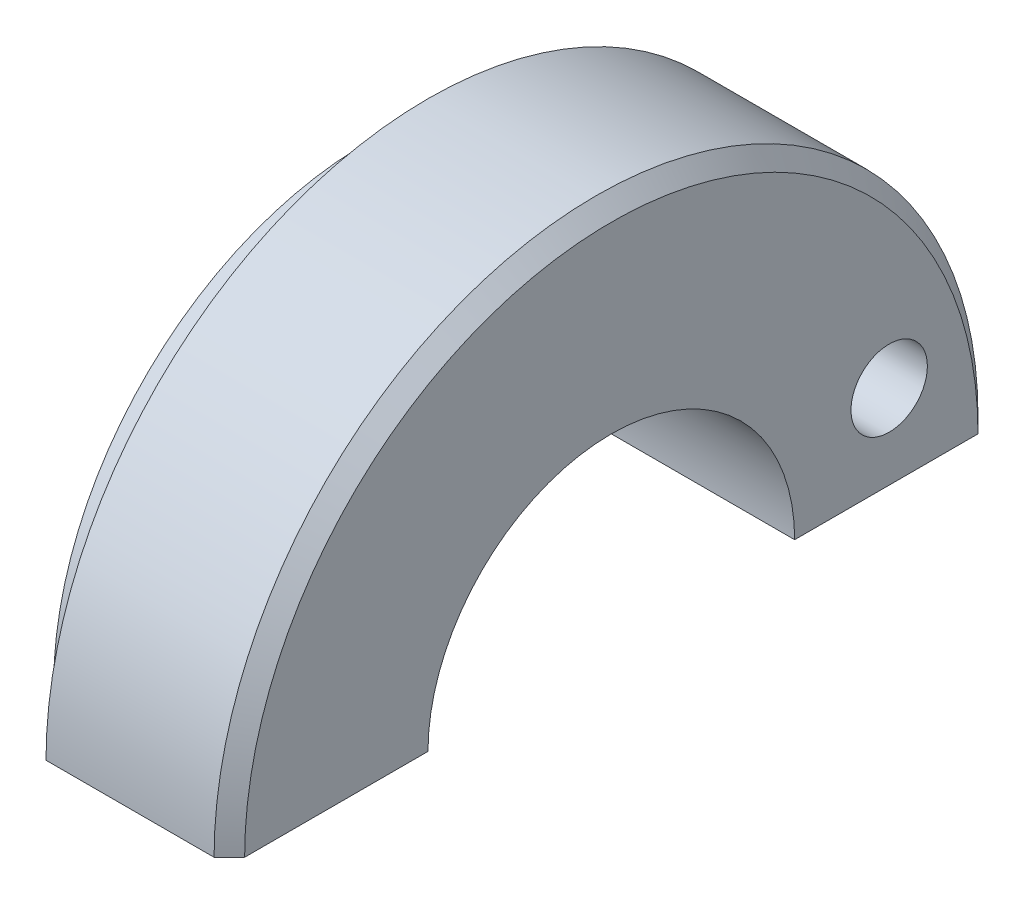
ISO-10303-21;
HEADER;
FILE_DESCRIPTION(('STEP AP214'),'2;1');
FILE_NAME('part.step','',(''),(''),'','','');
FILE_SCHEMA(('AUTOMOTIVE_DESIGN { 1 0 10303 214 1 1 1 1 }'));
ENDSEC;
DATA;
#1=APPLICATION_CONTEXT('core data for automotive mechanical design processes');
#2=APPLICATION_PROTOCOL_DEFINITION('international standard','automotive_design',2000,#1);
#3=PRODUCT_CONTEXT('',#1,'mechanical');
#4=PRODUCT('Part','Part','',(#3));
#5=PRODUCT_RELATED_PRODUCT_CATEGORY('part','',(#4));
#6=PRODUCT_DEFINITION_FORMATION('','',#4);
#7=PRODUCT_DEFINITION_CONTEXT('part definition',#1,'design');
#8=PRODUCT_DEFINITION('design','',#6,#7);
#9=PRODUCT_DEFINITION_SHAPE('','',#8);
#10=(LENGTH_UNIT() NAMED_UNIT(*) SI_UNIT(.MILLI.,.METRE.));
#11=(NAMED_UNIT(*) PLANE_ANGLE_UNIT() SI_UNIT($,.RADIAN.));
#12=(NAMED_UNIT(*) SI_UNIT($,.STERADIAN.) SOLID_ANGLE_UNIT());
#13=UNCERTAINTY_MEASURE_WITH_UNIT(LENGTH_MEASURE(1.E-05),#10,'distance_accuracy_value','');
#14=(GEOMETRIC_REPRESENTATION_CONTEXT(3) GLOBAL_UNCERTAINTY_ASSIGNED_CONTEXT((#13)) GLOBAL_UNIT_ASSIGNED_CONTEXT((#10,
#11,#12)) REPRESENTATION_CONTEXT('',''));
#15=CARTESIAN_POINT('',(0.,0.,0.));
#16=DIRECTION('',(0.,0.,1.));
#17=DIRECTION('',(1.,0.,0.));
#18=AXIS2_PLACEMENT_3D('',#15,#16,#17);
#19=CARTESIAN_POINT('',(-6.3628167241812,-0.100838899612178,-8.99999999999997));
#20=DIRECTION('',(1.,0.,0.));
#21=DIRECTION('',(0.,0.,-1.));
#22=AXIS2_PLACEMENT_3D('',#19,#20,#21);
#23=PLANE('',#22);
#24=CARTESIAN_POINT('',(-6.3628167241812,-0.10083889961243,0.));
#25=DIRECTION('',(1.,0.,0.));
#26=DIRECTION('',(0.,0.,-1.));
#27=AXIS2_PLACEMENT_3D('',#24,#25,#26);
#28=CIRCLE('',#27,10.2499999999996);
#29=CARTESIAN_POINT('',(-6.3628167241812,-0.100838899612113,-10.2499999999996));
#30=VERTEX_POINT('',#29);
#31=CARTESIAN_POINT('',(-6.3628167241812,-0.100838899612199,10.2499999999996));
#32=VERTEX_POINT('',#31);
#33=EDGE_CURVE('E11',#30,#32,#28,.T.);
#34=ORIENTED_EDGE('',*,*,#33,.T.);
#35=DIRECTION('',(0.,0.,1.));
#36=VECTOR('',#35,1.);
#37=CARTESIAN_POINT('',(-6.3628167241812,-0.100838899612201,8.99999999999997));
#38=LINE('',#37,#36);
#39=CARTESIAN_POINT('',(-6.3628167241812,-0.100838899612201,8.99999999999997));
#40=VERTEX_POINT('',#39);
#41=EDGE_CURVE('E435',#40,#32,#38,.T.);
#42=ORIENTED_EDGE('',*,*,#41,.F.);
#43=CARTESIAN_POINT('',(-6.3628167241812,-0.10083889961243,0.));
#44=DIRECTION('',(1.,0.,0.));
#45=DIRECTION('',(0.,0.,-1.));
#46=AXIS2_PLACEMENT_3D('',#43,#44,#45);
#47=CIRCLE('',#46,8.99999999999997);
#48=CARTESIAN_POINT('',(-6.3628167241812,-0.100838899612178,-8.99999999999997));
#49=VERTEX_POINT('',#48);
#50=EDGE_CURVE('E365',#49,#40,#47,.T.);
#51=ORIENTED_EDGE('',*,*,#50,.F.);
#52=DIRECTION('',(0.,0.,-1.));
#53=VECTOR('',#52,1.);
#54=CARTESIAN_POINT('',(-6.3628167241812,-0.100838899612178,-8.99999999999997));
#55=LINE('',#54,#53);
#56=EDGE_CURVE('E464',#49,#30,#55,.T.);
#57=ORIENTED_EDGE('',*,*,#56,.T.);
#58=EDGE_LOOP('',(#34,#42,#51,#57));
#59=FACE_BOUND('',#58,.T.);
#60=ADVANCED_FACE('F350',(#59),#23,.T.);
#61=CARTESIAN_POINT('',(-6.8628167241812,-0.10083889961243,0.));
#62=DIRECTION('',(1.,0.,0.));
#63=DIRECTION('',(0.,0.,-1.));
#64=AXIS2_PLACEMENT_3D('',#61,#62,#63);
#65=CYLINDRICAL_SURFACE('',#64,10.2499999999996);
#66=CARTESIAN_POINT('',(-6.8628167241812,-0.10083889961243,0.));
#67=DIRECTION('',(1.,0.,0.));
#68=DIRECTION('',(0.,0.,-1.));
#69=AXIS2_PLACEMENT_3D('',#66,#67,#68);
#70=CIRCLE('',#69,10.2499999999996);
#71=CARTESIAN_POINT('',(-6.8628167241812,-0.100838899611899,-10.2499999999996));
#72=VERTEX_POINT('',#71);
#73=CARTESIAN_POINT('',(-6.8628167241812,-0.100838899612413,10.2499999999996));
#74=VERTEX_POINT('',#73);
#75=EDGE_CURVE('E358',#72,#74,#70,.T.);
#76=ORIENTED_EDGE('',*,*,#75,.T.);
#77=DIRECTION('',(-1.,-4.28124332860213E-13,0.));
#78=VECTOR('',#77,1.);
#79=CARTESIAN_POINT('',(-6.3628167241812,-0.100838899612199,10.2499999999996));
#80=LINE('',#79,#78);
#81=EDGE_CURVE('E440',#32,#74,#80,.T.);
#82=ORIENTED_EDGE('',*,*,#81,.F.);
#83=ORIENTED_EDGE('',*,*,#33,.F.);
#84=DIRECTION('',(-1.,4.28124332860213E-13,0.));
#85=VECTOR('',#84,1.);
#86=CARTESIAN_POINT('',(-6.3628167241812,-0.100838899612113,-10.2499999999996));
#87=LINE('',#86,#85);
#88=EDGE_CURVE('E466',#30,#72,#87,.T.);
#89=ORIENTED_EDGE('',*,*,#88,.T.);
#90=EDGE_LOOP('',(#76,#82,#83,#89));
#91=FACE_BOUND('',#90,.T.);
#92=ADVANCED_FACE('F352',(#91),#65,.T.);
#93=CARTESIAN_POINT('',(-6.8628167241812,-0.100838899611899,-10.2499999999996));
#94=DIRECTION('',(-1.,0.,0.));
#95=DIRECTION('',(0.,0.,1.));
#96=AXIS2_PLACEMENT_3D('',#93,#94,#95);
#97=PLANE('',#96);
#98=CARTESIAN_POINT('',(-6.8628167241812,-0.10083889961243,0.));
#99=DIRECTION('',(1.,0.,0.));
#100=DIRECTION('',(0.,0.,-1.));
#101=AXIS2_PLACEMENT_3D('',#98,#99,#100);
#102=CIRCLE('',#101,5.99999999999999);
#103=CARTESIAN_POINT('',(-6.8628167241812,-0.10083889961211,-5.99999999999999));
#104=VERTEX_POINT('',#103);
#105=CARTESIAN_POINT('',(-6.8628167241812,-0.10083889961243,5.99999999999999));
#106=VERTEX_POINT('',#105);
#107=EDGE_CURVE('E498',#104,#106,#102,.T.);
#108=ORIENTED_EDGE('',*,*,#107,.T.);
#109=DIRECTION('',(0.,0.,-1.));
#110=VECTOR('',#109,1.);
#111=CARTESIAN_POINT('',(-6.8628167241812,-0.100838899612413,10.2499999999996));
#112=LINE('',#111,#110);
#113=EDGE_CURVE('E443',#74,#106,#112,.T.);
#114=ORIENTED_EDGE('',*,*,#113,.F.);
#115=ORIENTED_EDGE('',*,*,#75,.F.);
#116=DIRECTION('',(0.,0.,1.));
#117=VECTOR('',#116,1.);
#118=CARTESIAN_POINT('',(-6.8628167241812,-0.100838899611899,-10.2499999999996));
#119=LINE('',#118,#117);
#120=EDGE_CURVE('E469',#72,#104,#119,.T.);
#121=ORIENTED_EDGE('',*,*,#120,.T.);
#122=EDGE_LOOP('',(#108,#114,#115,#121));
#123=FACE_BOUND('',#122,.T.);
#124=ADVANCED_FACE('F508',(#123),#97,.T.);
#125=CARTESIAN_POINT('',(-6.8628167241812,-0.10083889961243,0.));
#126=DIRECTION('',(1.,0.,0.));
#127=DIRECTION('',(0.,0.,-1.));
#128=AXIS2_PLACEMENT_3D('',#125,#126,#127);
#129=CYLINDRICAL_SURFACE('',#128,5.99999999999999);
#130=CARTESIAN_POINT('',(1.13718327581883,-0.10083889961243,0.));
#131=DIRECTION('',(1.,0.,0.));
#132=DIRECTION('',(0.,0.,-1.));
#133=AXIS2_PLACEMENT_3D('',#130,#131,#132);
#134=CIRCLE('',#133,5.99999999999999);
#135=CARTESIAN_POINT('',(1.13718327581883,-0.10083889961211,-5.99999999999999));
#136=VERTEX_POINT('',#135);
#137=CARTESIAN_POINT('',(1.13718327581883,-0.10083889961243,5.99999999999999));
#138=VERTEX_POINT('',#137);
#139=EDGE_CURVE('E496',#136,#138,#134,.T.);
#140=ORIENTED_EDGE('',*,*,#139,.T.);
#141=DIRECTION('',(1.,0.,0.));
#142=VECTOR('',#141,1.);
#143=CARTESIAN_POINT('',(-6.8628167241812,-0.10083889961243,5.99999999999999));
#144=LINE('',#143,#142);
#145=EDGE_CURVE('E446',#106,#138,#144,.T.);
#146=ORIENTED_EDGE('',*,*,#145,.F.);
#147=ORIENTED_EDGE('',*,*,#107,.F.);
#148=DIRECTION('',(1.,0.,0.));
#149=VECTOR('',#148,1.);
#150=CARTESIAN_POINT('',(-6.8628167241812,-0.10083889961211,-5.99999999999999));
#151=LINE('',#150,#149);
#152=EDGE_CURVE('E472',#104,#136,#151,.T.);
#153=ORIENTED_EDGE('',*,*,#152,.T.);
#154=EDGE_LOOP('',(#140,#146,#147,#153));
#155=FACE_BOUND('',#154,.T.);
#156=ADVANCED_FACE('F511',(#155),#129,.F.);
#157=CARTESIAN_POINT('',(1.13718327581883,-0.10083889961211,-5.99999999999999));
#158=DIRECTION('',(1.,0.,0.));
#159=DIRECTION('',(0.,0.,-1.));
#160=AXIS2_PLACEMENT_3D('',#157,#158,#159);
#161=PLANE('',#160);
#162=CARTESIAN_POINT('',(1.13718327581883,2.64916110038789,-9.09326673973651));
#163=DIRECTION('',(1.,0.,0.));
#164=DIRECTION('',(0.,0.,-1.));
#165=AXIS2_PLACEMENT_3D('',#162,#163,#164);
#166=CIRCLE('',#165,1.25);
#167=CARTESIAN_POINT('',(1.13718327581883,2.64916110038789,-10.3432667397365));
#168=VERTEX_POINT('',#167);
#169=EDGE_CURVE('E432',#168,#168,#166,.T.);
#170=ORIENTED_EDGE('',*,*,#169,.F.);
#171=EDGE_LOOP('',(#170));
#172=FACE_BOUND('',#171,.T.);
#173=CARTESIAN_POINT('',(1.13718327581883,-0.10083889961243,0.));
#174=DIRECTION('',(1.,0.,0.));
#175=DIRECTION('',(0.,0.,-1.));
#176=AXIS2_PLACEMENT_3D('',#173,#174,#175);
#177=CIRCLE('',#176,11.9999999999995);
#178=CARTESIAN_POINT('',(1.13718327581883,-0.100838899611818,-11.9999999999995));
#179=VERTEX_POINT('',#178);
#180=CARTESIAN_POINT('',(1.13718327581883,-0.100838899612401,11.9999999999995));
#181=VERTEX_POINT('',#180);
#182=EDGE_CURVE('E494',#179,#181,#177,.T.);
#183=ORIENTED_EDGE('',*,*,#182,.T.);
#184=DIRECTION('',(0.,0.,1.));
#185=VECTOR('',#184,1.);
#186=CARTESIAN_POINT('',(1.13718327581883,-0.10083889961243,5.99999999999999));
#187=LINE('',#186,#185);
#188=EDGE_CURVE('E449',#138,#181,#187,.T.);
#189=ORIENTED_EDGE('',*,*,#188,.F.);
#190=ORIENTED_EDGE('',*,*,#139,.F.);
#191=DIRECTION('',(0.,0.,-1.));
#192=VECTOR('',#191,1.);
#193=CARTESIAN_POINT('',(1.13718327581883,-0.10083889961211,-5.99999999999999));
#194=LINE('',#193,#192);
#195=EDGE_CURVE('E475',#136,#179,#194,.T.);
#196=ORIENTED_EDGE('',*,*,#195,.T.);
#197=EDGE_LOOP('',(#183,#189,#190,#196));
#198=FACE_BOUND('',#197,.T.);
#199=ADVANCED_FACE('F516',(#172,#198),#161,.T.);
#200=CARTESIAN_POINT('',(1.13718327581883,-0.10083889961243,0.));
#201=DIRECTION('',(-1.,0.,0.));
#202=DIRECTION('',(0.,0.,1.));
#203=AXIS2_PLACEMENT_3D('',#200,#201,#202);
#204=CONICAL_SURFACE('',#203,11.9999999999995,0.785398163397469);
#205=CARTESIAN_POINT('',(0.63718327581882,-0.10083889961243,0.));
#206=DIRECTION('',(1.,0.,0.));
#207=DIRECTION('',(0.,0.,-1.));
#208=AXIS2_PLACEMENT_3D('',#205,#206,#207);
#209=CIRCLE('',#208,12.4999999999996);
#210=CARTESIAN_POINT('',(0.63718327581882,-0.100838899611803,-12.4999999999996));
#211=VERTEX_POINT('',#210);
#212=CARTESIAN_POINT('',(0.63718327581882,-0.100838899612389,12.4999999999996));
#213=VERTEX_POINT('',#212);
#214=EDGE_CURVE('E492',#211,#213,#209,.T.);
#215=ORIENTED_EDGE('',*,*,#214,.T.);
#216=DIRECTION('',(-0.707106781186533,0.,0.707106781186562));
#217=VECTOR('',#216,1.);
#218=CARTESIAN_POINT('',(1.13718327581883,-0.100838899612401,11.9999999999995));
#219=LINE('',#218,#217);
#220=EDGE_CURVE('E452',#181,#213,#219,.T.);
#221=ORIENTED_EDGE('',*,*,#220,.F.);
#222=ORIENTED_EDGE('',*,*,#182,.F.);
#223=DIRECTION('',(-0.707106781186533,0.,-0.707106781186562));
#224=VECTOR('',#223,1.);
#225=CARTESIAN_POINT('',(1.13718327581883,-0.100838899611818,-11.9999999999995));
#226=LINE('',#225,#224);
#227=EDGE_CURVE('E478',#179,#211,#226,.T.);
#228=ORIENTED_EDGE('',*,*,#227,.T.);
#229=EDGE_LOOP('',(#215,#221,#222,#228));
#230=FACE_BOUND('',#229,.T.);
#231=ADVANCED_FACE('F519',(#230),#204,.T.);
#232=CARTESIAN_POINT('',(-6.8628167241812,-0.10083889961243,0.));
#233=DIRECTION('',(1.,0.,0.));
#234=DIRECTION('',(0.,0.,-1.));
#235=AXIS2_PLACEMENT_3D('',#232,#233,#234);
#236=CYLINDRICAL_SURFACE('',#235,12.4999999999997);
#237=CARTESIAN_POINT('',(-4.86281672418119,-0.10083889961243,0.));
#238=DIRECTION('',(1.,0.,0.));
#239=DIRECTION('',(0.,0.,-1.));
#240=AXIS2_PLACEMENT_3D('',#237,#238,#239);
#241=CIRCLE('',#240,12.4999999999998);
#242=CARTESIAN_POINT('',(-4.86281672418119,-0.100838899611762,-12.4999999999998));
#243=VERTEX_POINT('',#242);
#244=CARTESIAN_POINT('',(-4.86281672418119,-0.10083889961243,12.4999999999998));
#245=VERTEX_POINT('',#244);
#246=EDGE_CURVE('E490',#243,#245,#241,.T.);
#247=ORIENTED_EDGE('',*,*,#246,.T.);
#248=DIRECTION('',(-1.,0.,0.));
#249=VECTOR('',#248,1.);
#250=CARTESIAN_POINT('',(0.63718327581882,-0.100838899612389,12.4999999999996));
#251=LINE('',#250,#249);
#252=EDGE_CURVE('E455',#213,#245,#251,.T.);
#253=ORIENTED_EDGE('',*,*,#252,.F.);
#254=ORIENTED_EDGE('',*,*,#214,.F.);
#255=DIRECTION('',(-1.,0.,0.));
#256=VECTOR('',#255,1.);
#257=CARTESIAN_POINT('',(0.63718327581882,-0.100838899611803,-12.4999999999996));
#258=LINE('',#257,#256);
#259=EDGE_CURVE('E481',#211,#243,#258,.T.);
#260=ORIENTED_EDGE('',*,*,#259,.T.);
#261=EDGE_LOOP('',(#247,#253,#254,#260));
#262=FACE_BOUND('',#261,.T.);
#263=ADVANCED_FACE('F524',(#262),#236,.T.);
#264=CARTESIAN_POINT('',(-4.86281672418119,-0.100838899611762,-12.4999999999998));
#265=DIRECTION('',(-1.,0.,0.));
#266=DIRECTION('',(0.,0.,1.));
#267=AXIS2_PLACEMENT_3D('',#264,#265,#266);
#268=PLANE('',#267);
#269=CARTESIAN_POINT('',(-4.8628167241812,-0.10083889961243,0.));
#270=DIRECTION('',(1.,0.,0.));
#271=DIRECTION('',(0.,0.,-1.));
#272=AXIS2_PLACEMENT_3D('',#269,#270,#271);
#273=CIRCLE('',#272,8.99999999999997);
#274=CARTESIAN_POINT('',(-4.8628167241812,-0.100838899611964,-8.99999999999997));
#275=VERTEX_POINT('',#274);
#276=CARTESIAN_POINT('',(-4.8628167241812,-0.100838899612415,8.99999999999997));
#277=VERTEX_POINT('',#276);
#278=EDGE_CURVE('E373',#275,#277,#273,.T.);
#279=ORIENTED_EDGE('',*,*,#278,.T.);
#280=DIRECTION('',(0.,0.,-1.));
#281=VECTOR('',#280,1.);
#282=CARTESIAN_POINT('',(-4.86281672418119,-0.10083889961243,12.4999999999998));
#283=LINE('',#282,#281);
#284=EDGE_CURVE('E458',#245,#277,#283,.T.);
#285=ORIENTED_EDGE('',*,*,#284,.F.);
#286=ORIENTED_EDGE('',*,*,#246,.F.);
#287=DIRECTION('',(0.,0.,1.));
#288=VECTOR('',#287,1.);
#289=CARTESIAN_POINT('',(-4.86281672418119,-0.100838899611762,-12.4999999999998));
#290=LINE('',#289,#288);
#291=EDGE_CURVE('E484',#243,#275,#290,.T.);
#292=ORIENTED_EDGE('',*,*,#291,.T.);
#293=EDGE_LOOP('',(#279,#285,#286,#292));
#294=FACE_BOUND('',#293,.T.);
#295=ADVANCED_FACE('F527',(#294),#268,.T.);
#296=CARTESIAN_POINT('',(-6.8628167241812,-0.10083889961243,0.));
#297=DIRECTION('',(1.,0.,0.));
#298=DIRECTION('',(0.,0.,-1.));
#299=AXIS2_PLACEMENT_3D('',#296,#297,#298);
#300=CYLINDRICAL_SURFACE('',#299,8.99999999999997);
#301=DIRECTION('',(-1.,-1.426990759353E-13,0.));
#302=VECTOR('',#301,1.);
#303=CARTESIAN_POINT('',(-4.8628167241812,-0.100838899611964,-8.99999999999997));
#304=LINE('',#303,#302);
#305=EDGE_CURVE('E486',#275,#49,#304,.T.);
#306=ORIENTED_EDGE('',*,*,#305,.T.);
#307=ORIENTED_EDGE('',*,*,#50,.T.);
#308=DIRECTION('',(-1.,1.426990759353E-13,0.));
#309=VECTOR('',#308,1.);
#310=CARTESIAN_POINT('',(-4.8628167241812,-0.100838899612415,8.99999999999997));
#311=LINE('',#310,#309);
#312=EDGE_CURVE('E461',#277,#40,#311,.T.);
#313=ORIENTED_EDGE('',*,*,#312,.F.);
#314=ORIENTED_EDGE('',*,*,#278,.F.);
#315=EDGE_LOOP('',(#306,#307,#313,#314));
#316=FACE_BOUND('',#315,.T.);
#317=ADVANCED_FACE('F529',(#316),#300,.T.);
#318=CARTESIAN_POINT('',(-6.3628167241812,-0.100838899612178,-8.99999999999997));
#319=DIRECTION('',(-1.426990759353E-13,1.,0.));
#320=DIRECTION('',(1.,1.426990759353E-13,0.));
#321=AXIS2_PLACEMENT_3D('',#318,#319,#320);
#322=PLANE('',#321);
#323=ORIENTED_EDGE('',*,*,#56,.F.);
#324=ORIENTED_EDGE('',*,*,#305,.F.);
#325=ORIENTED_EDGE('',*,*,#291,.F.);
#326=ORIENTED_EDGE('',*,*,#259,.F.);
#327=ORIENTED_EDGE('',*,*,#227,.F.);
#328=ORIENTED_EDGE('',*,*,#195,.F.);
#329=ORIENTED_EDGE('',*,*,#152,.F.);
#330=ORIENTED_EDGE('',*,*,#120,.F.);
#331=ORIENTED_EDGE('',*,*,#88,.F.);
#332=EDGE_LOOP('',(#323,#324,#325,#326,#327,#328,#329,#330,#331));
#333=FACE_BOUND('',#332,.T.);
#334=ADVANCED_FACE('F531',(#333),#322,.F.);
#335=CARTESIAN_POINT('',(-6.3628167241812,-0.100838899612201,8.99999999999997));
#336=DIRECTION('',(-1.426990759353E-13,-1.,0.));
#337=DIRECTION('',(1.,-1.426990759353E-13,0.));
#338=AXIS2_PLACEMENT_3D('',#335,#336,#337);
#339=PLANE('',#338);
#340=ORIENTED_EDGE('',*,*,#41,.T.);
#341=ORIENTED_EDGE('',*,*,#81,.T.);
#342=ORIENTED_EDGE('',*,*,#113,.T.);
#343=ORIENTED_EDGE('',*,*,#145,.T.);
#344=ORIENTED_EDGE('',*,*,#188,.T.);
#345=ORIENTED_EDGE('',*,*,#220,.T.);
#346=ORIENTED_EDGE('',*,*,#252,.T.);
#347=ORIENTED_EDGE('',*,*,#284,.T.);
#348=ORIENTED_EDGE('',*,*,#312,.T.);
#349=EDGE_LOOP('',(#340,#341,#342,#343,#344,#345,#346,#347,#348));
#350=FACE_BOUND('',#349,.T.);
#351=ADVANCED_FACE('F506',(#350),#339,.T.);
#352=CARTESIAN_POINT('',(1.13718327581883,2.64916110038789,-9.09326673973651));
#353=DIRECTION('',(1.,0.,0.));
#354=DIRECTION('',(0.,0.,-1.));
#355=AXIS2_PLACEMENT_3D('',#352,#353,#354);
#356=CYLINDRICAL_SURFACE('',#355,1.25);
#357=CARTESIAN_POINT('',(-3.36281672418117,2.64916110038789,-9.09326673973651));
#358=DIRECTION('',(1.,0.,0.));
#359=DIRECTION('',(0.,0.,-1.));
#360=AXIS2_PLACEMENT_3D('',#357,#358,#359);
#361=CIRCLE('',#360,1.25);
#362=CARTESIAN_POINT('',(-3.36281672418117,2.64916110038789,-10.3432667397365));
#363=VERTEX_POINT('',#362);
#364=EDGE_CURVE('E430',#363,#363,#361,.T.);
#365=ORIENTED_EDGE('',*,*,#364,.F.);
#366=EDGE_LOOP('',(#365));
#367=FACE_BOUND('',#366,.T.);
#368=ORIENTED_EDGE('',*,*,#169,.T.);
#369=EDGE_LOOP('',(#368));
#370=FACE_BOUND('',#369,.T.);
#371=ADVANCED_FACE('F426',(#367,#370),#356,.F.);
#372=CARTESIAN_POINT('',(-3.36281672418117,2.64916110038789,-9.09326673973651));
#373=DIRECTION('',(1.,0.,0.));
#374=DIRECTION('',(0.,0.,-1.));
#375=AXIS2_PLACEMENT_3D('',#372,#373,#374);
#376=CONICAL_SURFACE('',#375,1.25,1.02974425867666);
#377=CARTESIAN_POINT('',(-4.11389249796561,2.64916110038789,-9.09326673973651));
#378=VERTEX_POINT('',#377);
#379=VERTEX_LOOP('',#378);
#380=FACE_BOUND('',#379,.T.);
#381=ORIENTED_EDGE('',*,*,#364,.T.);
#382=EDGE_LOOP('',(#381));
#383=FACE_BOUND('',#382,.T.);
#384=ADVANCED_FACE('F423',(#380,#383),#376,.F.);
#385=CLOSED_SHELL('',(#60,#92,#124,#156,#199,#231,#263,#295,#317,#334,#351,#371,#384));
#386=MANIFOLD_SOLID_BREP('B2',#385);
#387=ADVANCED_BREP_SHAPE_REPRESENTATION('',(#18,#386),#14);
#388=SHAPE_DEFINITION_REPRESENTATION(#9,#387);
ENDSEC;
END-ISO-10303-21;
